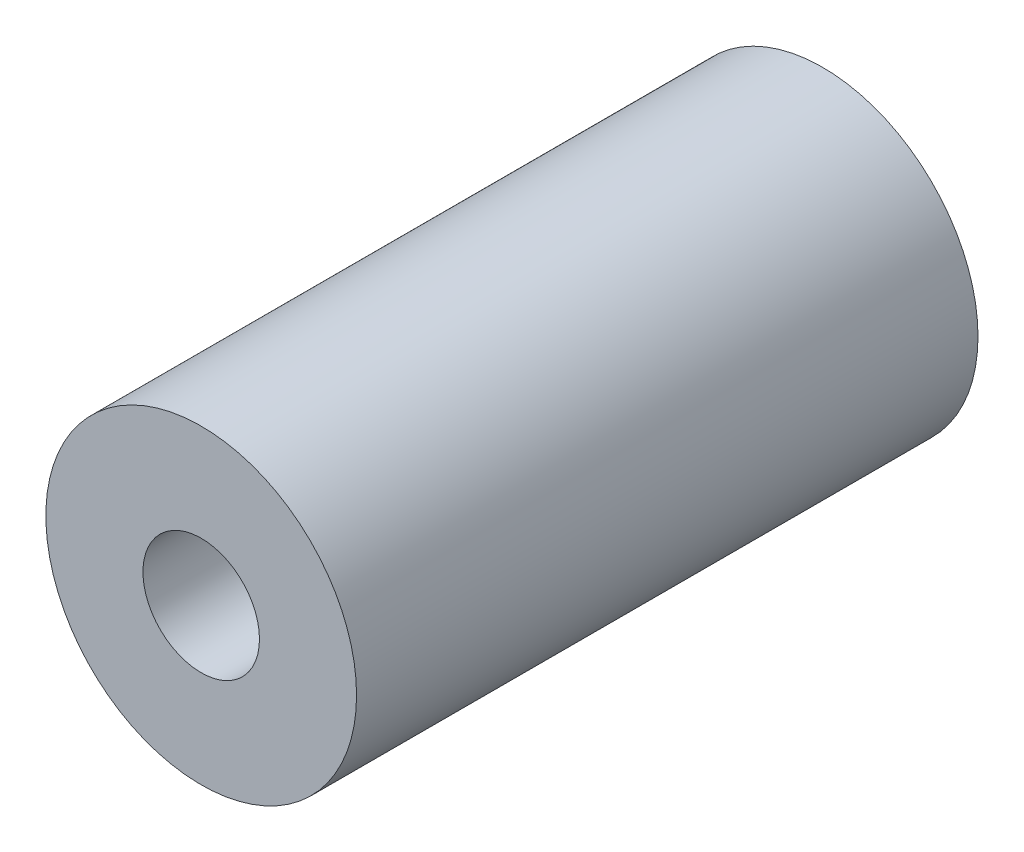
from build123d import *

# Parameters (mm, degrees)
SKETCH1_R      = 12.7
SKETCH1_R_2    = 4.7625
EXTRUDE1_DEPTH = 50.8


with BuildPart() as part:
    # Sketch1 → Extrude1 (new body)
    with BuildSketch(Plane.XY):
        Circle(SKETCH1_R)
        Circle(SKETCH1_R_2, mode=Mode.SUBTRACT)
    extrude(amount=EXTRUDE1_DEPTH)


solid = part.part
